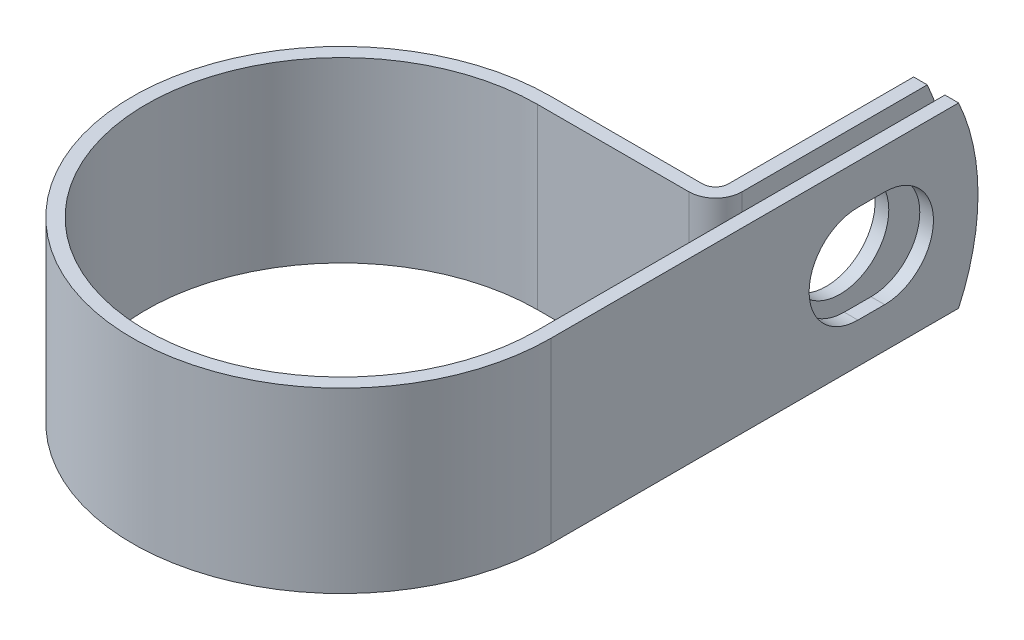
from build123d import *

# Parameters (mm, degrees)
EXTRUDE_THIN1_DEPTH = 7.9375
SKETCH2_R           = 4.3561
CUT_EXTRUDE1_DEPTH  = 1.2192
CUT_EXTRUDE2_REACH  = 55.95
CUT_EXTRUDE3_DEPTH  = 52.252802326


with BuildPart() as part:
    # Sketch1 → Extrude-Thin1 (new, symmetric)
    with BuildSketch(Plane(origin=(0, 0, 0), x_dir=(1, 0, 0), z_dir=(0, 1, 0))):
        with BuildLine():
            Line((17.4625, 38.1), (17.4625, 17.4625))
            Line((17.4625, 17.4625), (17.4625, 0))
            ThreePointArc((17.4625, 0), (-12.347852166, -12.347852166), (0, 17.4625))
            Line((0, 17.4625), (13.51026, 17.4625))
            ThreePointArc((13.51026, 17.4625), (15.191363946, 18.158836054), (15.8877, 19.83994))
            Line((15.8877, 19.83994), (15.8877, 38.1))
            Line((15.8877, 38.1), (14.6685, 38.1))
            Line((14.6685, 38.1), (14.6685, 19.83994))
            ThreePointArc((14.6685, 19.83994), (14.329259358, 19.020940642), (13.51026, 18.6817))
            Line((13.51026, 18.6817), (0, 18.6817))
            ThreePointArc((0, 18.6817), (-13.209956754, -13.209956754), (18.6817, 0))
            Line((18.6817, 0), (18.6817, 17.4625))
            Line((18.6817, 17.4625), (18.6817, 38.1))
            Line((18.6817, 38.1), (17.4625, 38.1))
        make_face()
    extrude(amount=EXTRUDE_THIN1_DEPTH, both=True)

    # Sketch2 → Cut-Extrude1 (cut)
    with BuildSketch(Plane.ZY.offset(-14.6685)):
        with Locations((-28.575, 0)):
            Circle(SKETCH2_R)
    extrude(amount=-CUT_EXTRUDE1_DEPTH, mode=Mode.SUBTRACT)

    # Sketch3 → Cut-Extrude2 (cut, up to next)
    with BuildSketch(Plane(origin=(18.6817, 0, 0), x_dir=(0, 0, -1), z_dir=(1, 0, 0)), mode=Mode.PRIVATE) as cut_extrude2_sk1:
        with BuildLine():
            Line((27.3812, 4.3561), (29.7688, 4.3561))
            ThreePointArc((29.7688, 4.3561), (34.1249, 0), (29.7688, -4.3561))
            Line((29.7688, -4.3561), (27.3812, -4.3561))
            ThreePointArc((27.3812, -4.3561), (23.0251, 0), (27.3812, 4.3561))
        make_face()
    cut_extrude2_tool1 = extrude(cut_extrude2_sk1.sketch, amount=-CUT_EXTRUDE2_REACH, mode=Mode.PRIVATE) & part.part
    add(cut_extrude2_tool1.solids().sort_by_distance((18.6817, 0, -28.575))[0], mode=Mode.SUBTRACT)

    # Sketch4 → Cut-Extrude3 (cut, through all)
    with BuildSketch(Plane.ZY.offset(-14.6685)):
        with BuildLine():
            Line((-36.367580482, 7.9375), (-38.1, 7.9375))
            Line((-38.1, 7.9375), (-38.1, 1.33e-07))
            ThreePointArc((-38.1, 1.33e-07), (-37.661856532, 4.06217878), (-36.367580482, 7.9375))
        make_face()
        with BuildLine():
            ThreePointArc((-36.367580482, -7.9375), (-37.66185656, -4.062178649), (-38.1, 1.33e-07))
            Line((-38.1, 1.33e-07), (-38.1, -7.9375))
            Line((-38.1, -7.9375), (-36.367580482, -7.9375))
        make_face()
    extrude(amount=-CUT_EXTRUDE3_DEPTH, mode=Mode.SUBTRACT)


solid = part.part
